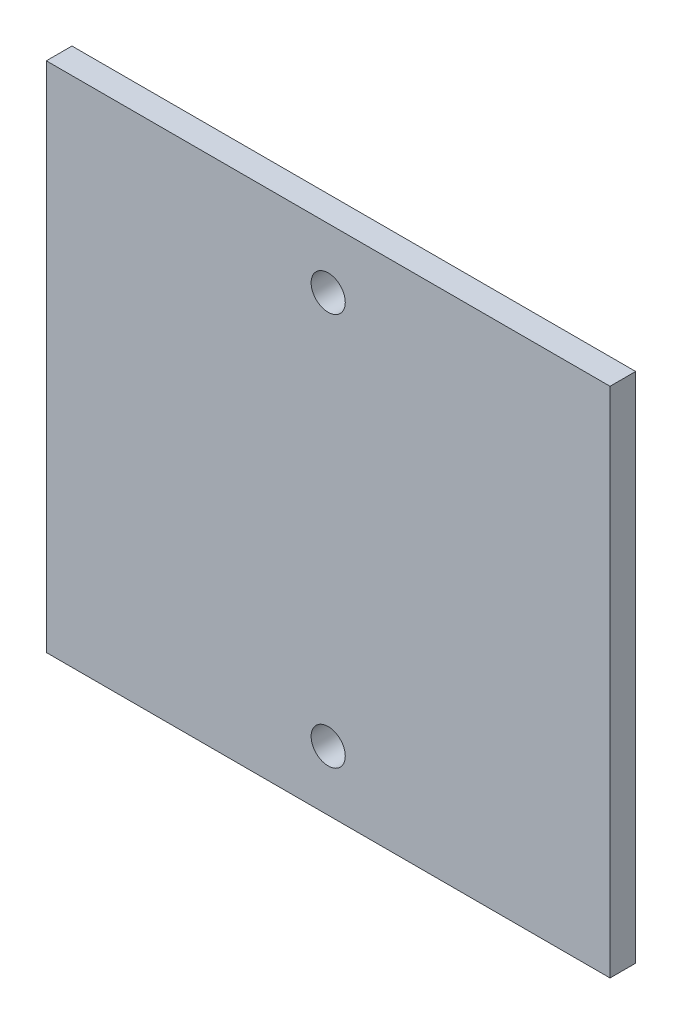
from build123d import *

# Parameters (mm, degrees)
ESQUISSE1_W             = 330
ESQUISSE1_H             = 300
BOSS_EXTRU_1_DEPTH      = 15
ESQUISSE2_R             = 10
ENL_V_MAT_EXTRU_1_DEPTH = 224.494966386


with BuildPart() as part:
    # Esquisse1 → Boss.-Extru.1 (new body)
    with BuildSketch(Plane.XY):
        Rectangle(ESQUISSE1_W, ESQUISSE1_H)
    extrude(amount=BOSS_EXTRU_1_DEPTH)

    # Esquisse2 → Enl_v. mat.-Extru.1 (cut, through all)
    with BuildSketch(Plane.XY.offset(15)):
        with Locations((0, 115)):
            Circle(ESQUISSE2_R)
        with Locations((0, -115)):
            Circle(ESQUISSE2_R)
    extrude(amount=-ENL_V_MAT_EXTRU_1_DEPTH, mode=Mode.SUBTRACT)


solid = part.part
